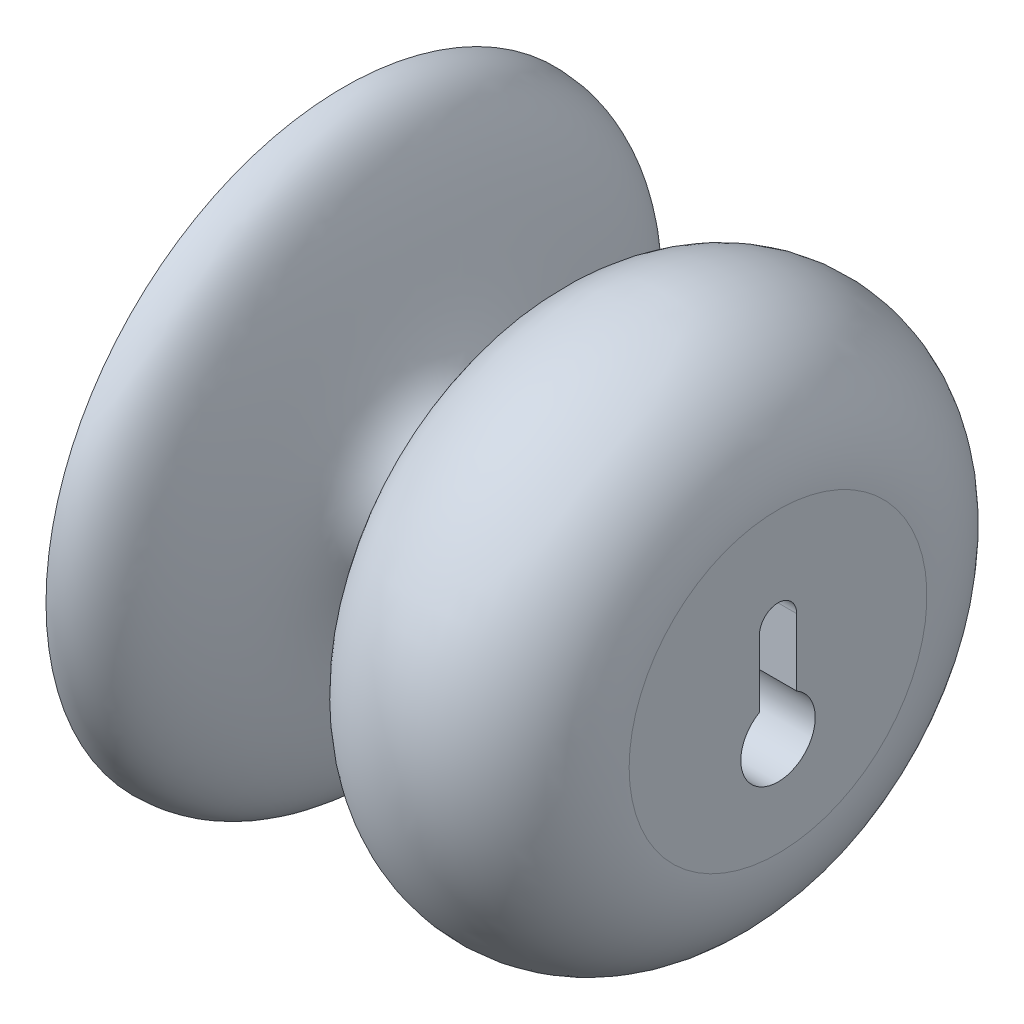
from build123d import *

# Parameters (mm, degrees)
SKETCH21_R         = 3.81
CUT_EXTRUDE1_DEPTH = 25.4


with BuildPart() as part:
    # Sketch1 → Revolve1 (revolve)
    with BuildSketch(Plane.XY, mode=Mode.PRIVATE) as revolve1_sk:
        with BuildLine():
            Line((-44.45, 0), (0, 0))
            Line((0, 0), (0, 15.24))
            ThreePointArc((0, 15.24), (-12.7, 27.94), (-25.4, 15.24))
            Line((-25.4, 15.24), (-25.4, 6.35))
            add(Edge.make_bspline(
                [(-44.45, 30.48), (-39.165438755, 30.48), (-37.217115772, 19.547201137), (-35.09067943, 8.986451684), (-29.521859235, 6.35), (-25.4, 6.35)],
                knots=[0, 0, 0, 0, 0.455503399, 0.702534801, 1, 1, 1, 1], degree=3))
            Line((-44.45, 30.48), (-44.45, 0))
        make_face()
    revolve(revolve1_sk.sketch.rotate(Axis((-44.45, 0, 0), (1, 0, 0)), 90), axis=Axis((-44.45, 0, 0), (1, 0, 0)))

    # Sketch21 → Cut-Extrude1 (cut)
    with BuildSketch(Plane(origin=(0, 1.248022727, 1.848126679), x_dir=(0, 0, -1), z_dir=(1, 0, 0))):
        with Locations((1.848126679, -6.328022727)):
            Circle(SKETCH21_R)
        with BuildLine():
            Line((3.753126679, 3.831977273), (3.753126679, -6.328022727))
            ThreePointArc((3.753126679, -6.328022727), (1.848126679, -8.233022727), (-0.056873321, -6.328022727))
            Line((-0.056873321, -6.328022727), (-0.056873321, 3.831977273))
            ThreePointArc((-0.056873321, 3.831977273), (1.848126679, 5.736977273), (3.753126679, 3.831977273))
        make_face()
    extrude(amount=-CUT_EXTRUDE1_DEPTH, mode=Mode.SUBTRACT)


solid = part.part
